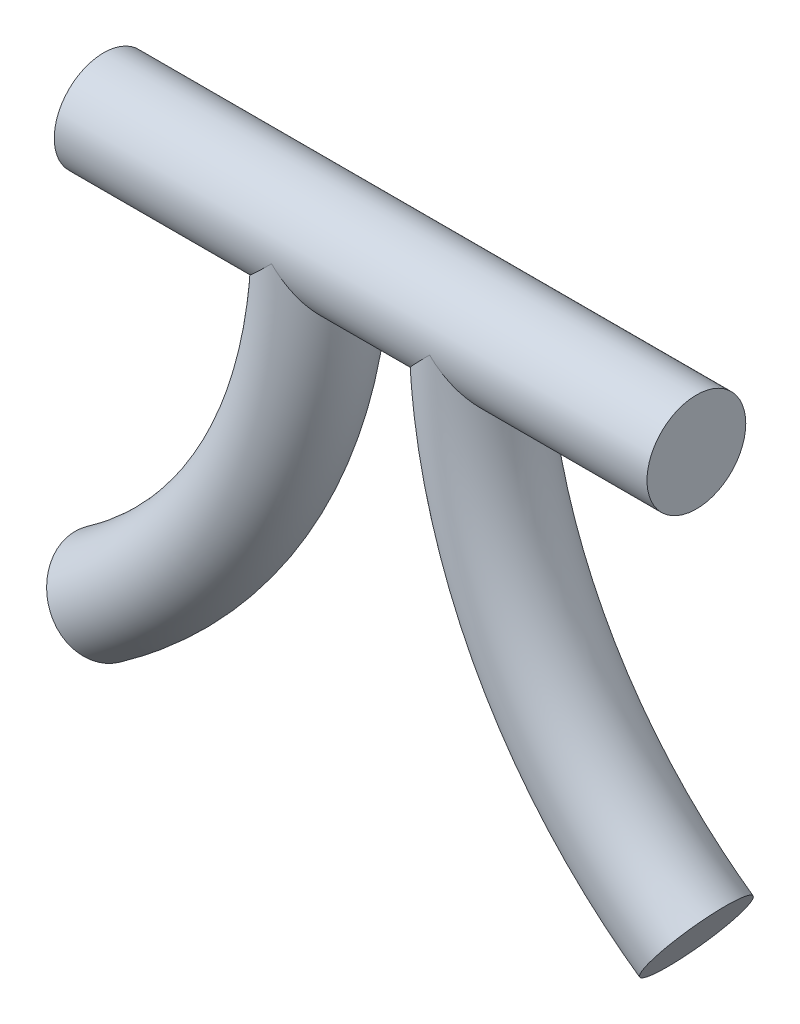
from build123d import *

# Parameters (mm, degrees)
SKETCH_1_R        = 25
EXTRUDE_1_DEPTH   = 150
SWEEP_1_PROFILE_R = 25


with BuildPart() as part:
    # Sketch 1 → Extrude 1 (new, symmetric)
    with BuildSketch(Plane(origin=(0, 0, 0), x_dir=(0, 0, -1), z_dir=(1, 0, 0))):
        Circle(SKETCH_1_R)
    extrude(amount=EXTRUDE_1_DEPTH, both=True)

    # Sweep 1: sweep along a path in Sketch 2
    with BuildLine(Plane.XY) as sweep_1_path:
        ThreePointArc((-40, 0), (-69.132072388, -119.582607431), (-150, -212.367605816))
    # Sweep 1 profile (on start of the path) → Sweep 1 (sweep)
    with BuildSketch(Plane(origin=(-40, 0, 0), x_dir=(-1, 0, 0), z_dir=(0, -1, 0))):
        Circle(SWEEP_1_PROFILE_R)
    sweep_1 = sweep(path=sweep_1_path.line)

    # Mirror 1: Sweep 1 across plane
    add(sweep_1.mirror(Plane(origin=(0, 0, 0), x_dir=(0, 0, 1), z_dir=(1, 0, 0))))


solid = part.part
